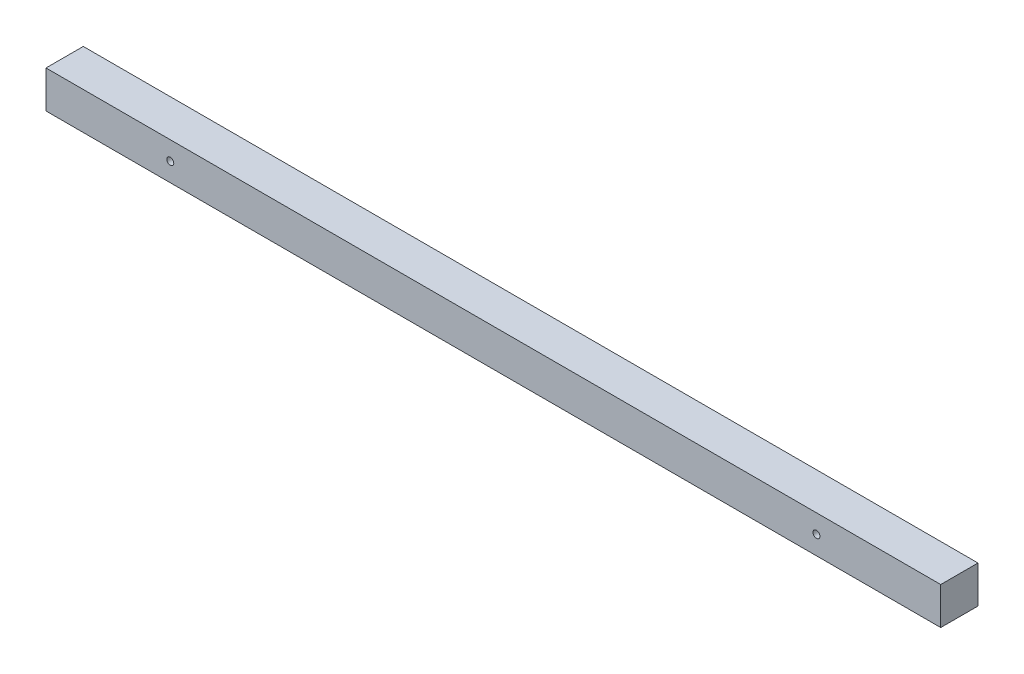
ISO-10303-21;
HEADER;
FILE_DESCRIPTION(('STEP AP214'),'2;1');
FILE_NAME('part.step','',(''),(''),'','','');
FILE_SCHEMA(('AUTOMOTIVE_DESIGN { 1 0 10303 214 1 1 1 1 }'));
ENDSEC;
DATA;
#1=APPLICATION_CONTEXT('core data for automotive mechanical design processes');
#2=APPLICATION_PROTOCOL_DEFINITION('international standard','automotive_design',2000,#1);
#3=PRODUCT_CONTEXT('',#1,'mechanical');
#4=PRODUCT('Part','Part','',(#3));
#5=PRODUCT_RELATED_PRODUCT_CATEGORY('part','',(#4));
#6=PRODUCT_DEFINITION_FORMATION('','',#4);
#7=PRODUCT_DEFINITION_CONTEXT('part definition',#1,'design');
#8=PRODUCT_DEFINITION('design','',#6,#7);
#9=PRODUCT_DEFINITION_SHAPE('','',#8);
#10=(LENGTH_UNIT() NAMED_UNIT(*) SI_UNIT(.MILLI.,.METRE.));
#11=(NAMED_UNIT(*) PLANE_ANGLE_UNIT() SI_UNIT($,.RADIAN.));
#12=(NAMED_UNIT(*) SI_UNIT($,.STERADIAN.) SOLID_ANGLE_UNIT());
#13=UNCERTAINTY_MEASURE_WITH_UNIT(LENGTH_MEASURE(1.E-05),#10,'distance_accuracy_value','');
#14=(GEOMETRIC_REPRESENTATION_CONTEXT(3) GLOBAL_UNCERTAINTY_ASSIGNED_CONTEXT((#13)) GLOBAL_UNIT_ASSIGNED_CONTEXT((#10,
#11,#12)) REPRESENTATION_CONTEXT('',''));
#15=CARTESIAN_POINT('',(0.,0.,0.));
#16=DIRECTION('',(0.,0.,1.));
#17=DIRECTION('',(1.,0.,0.));
#18=AXIS2_PLACEMENT_3D('',#15,#16,#17);
#19=CARTESIAN_POINT('',(457.2,19.05,19.05));
#20=DIRECTION('',(0.,0.,-1.));
#21=DIRECTION('',(-1.,0.,0.));
#22=AXIS2_PLACEMENT_3D('',#19,#20,#21);
#23=PLANE('',#22);
#24=CARTESIAN_POINT('',(330.2,0.,19.0500000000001));
#25=DIRECTION('',(0.,0.,1.));
#26=DIRECTION('',(1.,0.,0.));
#27=AXIS2_PLACEMENT_3D('',#24,#25,#26);
#28=CIRCLE('',#27,3.56869999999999);
#29=CARTESIAN_POINT('',(333.7687,0.,19.0500000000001));
#30=VERTEX_POINT('',#29);
#31=EDGE_CURVE('E118',#30,#30,#28,.T.);
#32=ORIENTED_EDGE('',*,*,#31,.F.);
#33=EDGE_LOOP('',(#32));
#34=FACE_BOUND('',#33,.T.);
#35=CARTESIAN_POINT('',(-330.2,0.,19.05));
#36=DIRECTION('',(0.,0.,1.));
#37=DIRECTION('',(1.,0.,0.));
#38=AXIS2_PLACEMENT_3D('',#35,#36,#37);
#39=CIRCLE('',#38,3.56869999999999);
#40=CARTESIAN_POINT('',(-326.6313,0.,19.05));
#41=VERTEX_POINT('',#40);
#42=EDGE_CURVE('E112',#41,#41,#39,.T.);
#43=ORIENTED_EDGE('',*,*,#42,.F.);
#44=EDGE_LOOP('',(#43));
#45=FACE_BOUND('',#44,.T.);
#46=DIRECTION('',(0.,-1.,0.));
#47=VECTOR('',#46,1.);
#48=CARTESIAN_POINT('',(-457.2,19.05,19.0500000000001));
#49=LINE('',#48,#47);
#50=CARTESIAN_POINT('',(-457.2,19.05,19.0500000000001));
#51=VERTEX_POINT('',#50);
#52=CARTESIAN_POINT('',(-457.2,-19.05,19.05));
#53=VERTEX_POINT('',#52);
#54=EDGE_CURVE('E98',#51,#53,#49,.T.);
#55=ORIENTED_EDGE('',*,*,#54,.T.);
#56=DIRECTION('',(-1.,0.,0.));
#57=VECTOR('',#56,1.);
#58=CARTESIAN_POINT('',(457.2,-19.05,19.05));
#59=LINE('',#58,#57);
#60=CARTESIAN_POINT('',(457.2,-19.05,19.05));
#61=VERTEX_POINT('',#60);
#62=EDGE_CURVE('E11',#61,#53,#59,.T.);
#63=ORIENTED_EDGE('',*,*,#62,.F.);
#64=DIRECTION('',(0.,-1.,0.));
#65=VECTOR('',#64,1.);
#66=CARTESIAN_POINT('',(457.2,19.05,19.05));
#67=LINE('',#66,#65);
#68=CARTESIAN_POINT('',(457.2,19.05,19.05));
#69=VERTEX_POINT('',#68);
#70=EDGE_CURVE('E86',#69,#61,#67,.T.);
#71=ORIENTED_EDGE('',*,*,#70,.F.);
#72=DIRECTION('',(-1.,0.,0.));
#73=VECTOR('',#72,1.);
#74=CARTESIAN_POINT('',(457.2,19.05,19.05));
#75=LINE('',#74,#73);
#76=EDGE_CURVE('E94',#69,#51,#75,.T.);
#77=ORIENTED_EDGE('',*,*,#76,.T.);
#78=EDGE_LOOP('',(#55,#63,#71,#77));
#79=FACE_BOUND('',#78,.T.);
#80=ADVANCED_FACE('F35',(#34,#45,#79),#23,.F.);
#81=CARTESIAN_POINT('',(457.2,-19.05,19.05));
#82=DIRECTION('',(0.,1.,0.));
#83=DIRECTION('',(0.,0.,1.));
#84=AXIS2_PLACEMENT_3D('',#81,#82,#83);
#85=PLANE('',#84);
#86=DIRECTION('',(0.,0.,-1.));
#87=VECTOR('',#86,1.);
#88=CARTESIAN_POINT('',(-457.2,-19.05,19.05));
#89=LINE('',#88,#87);
#90=CARTESIAN_POINT('',(-457.2,-19.05,-19.05));
#91=VERTEX_POINT('',#90);
#92=EDGE_CURVE('E90',#53,#91,#89,.T.);
#93=ORIENTED_EDGE('',*,*,#92,.T.);
#94=DIRECTION('',(-1.,0.,0.));
#95=VECTOR('',#94,1.);
#96=CARTESIAN_POINT('',(457.2,-19.05,-19.05));
#97=LINE('',#96,#95);
#98=CARTESIAN_POINT('',(457.2,-19.05,-19.05));
#99=VERTEX_POINT('',#98);
#100=EDGE_CURVE('E43',#99,#91,#97,.T.);
#101=ORIENTED_EDGE('',*,*,#100,.F.);
#102=DIRECTION('',(0.,0.,-1.));
#103=VECTOR('',#102,1.);
#104=CARTESIAN_POINT('',(457.2,-19.05,19.05));
#105=LINE('',#104,#103);
#106=EDGE_CURVE('E81',#61,#99,#105,.T.);
#107=ORIENTED_EDGE('',*,*,#106,.F.);
#108=ORIENTED_EDGE('',*,*,#62,.T.);
#109=EDGE_LOOP('',(#93,#101,#107,#108));
#110=FACE_BOUND('',#109,.T.);
#111=ADVANCED_FACE('F89',(#110),#85,.F.);
#112=CARTESIAN_POINT('',(457.2,19.05,-19.05));
#113=DIRECTION('',(0.,0.,1.));
#114=DIRECTION('',(0.,-1.,0.));
#115=AXIS2_PLACEMENT_3D('',#112,#113,#114);
#116=PLANE('',#115);
#117=CARTESIAN_POINT('',(330.2,0.,-19.0499999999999));
#118=DIRECTION('',(0.,0.,1.));
#119=DIRECTION('',(1.,0.,0.));
#120=AXIS2_PLACEMENT_3D('',#117,#118,#119);
#121=CIRCLE('',#120,3.56869999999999);
#122=CARTESIAN_POINT('',(333.7687,0.,-19.0499999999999));
#123=VERTEX_POINT('',#122);
#124=EDGE_CURVE('E115',#123,#123,#121,.T.);
#125=ORIENTED_EDGE('',*,*,#124,.T.);
#126=EDGE_LOOP('',(#125));
#127=FACE_BOUND('',#126,.T.);
#128=CARTESIAN_POINT('',(-330.2,0.,-19.05));
#129=DIRECTION('',(0.,0.,1.));
#130=DIRECTION('',(1.,0.,0.));
#131=AXIS2_PLACEMENT_3D('',#128,#129,#130);
#132=CIRCLE('',#131,3.56869999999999);
#133=CARTESIAN_POINT('',(-326.6313,0.,-19.05));
#134=VERTEX_POINT('',#133);
#135=EDGE_CURVE('E101',#134,#134,#132,.T.);
#136=ORIENTED_EDGE('',*,*,#135,.T.);
#137=EDGE_LOOP('',(#136));
#138=FACE_BOUND('',#137,.T.);
#139=DIRECTION('',(0.,1.,0.));
#140=VECTOR('',#139,1.);
#141=CARTESIAN_POINT('',(-457.2,19.05,-19.0499999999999));
#142=LINE('',#141,#140);
#143=CARTESIAN_POINT('',(-457.2,19.05,-19.0499999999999));
#144=VERTEX_POINT('',#143);
#145=EDGE_CURVE('E68',#91,#144,#142,.T.);
#146=ORIENTED_EDGE('',*,*,#145,.T.);
#147=DIRECTION('',(-1.,0.,0.));
#148=VECTOR('',#147,1.);
#149=CARTESIAN_POINT('',(457.2,19.05,-19.05));
#150=LINE('',#149,#148);
#151=CARTESIAN_POINT('',(457.2,19.05,-19.05));
#152=VERTEX_POINT('',#151);
#153=EDGE_CURVE('E91',#152,#144,#150,.T.);
#154=ORIENTED_EDGE('',*,*,#153,.F.);
#155=DIRECTION('',(0.,1.,0.));
#156=VECTOR('',#155,1.);
#157=CARTESIAN_POINT('',(457.2,19.05,-19.05));
#158=LINE('',#157,#156);
#159=EDGE_CURVE('E84',#99,#152,#158,.T.);
#160=ORIENTED_EDGE('',*,*,#159,.F.);
#161=ORIENTED_EDGE('',*,*,#100,.T.);
#162=EDGE_LOOP('',(#146,#154,#160,#161));
#163=FACE_BOUND('',#162,.T.);
#164=ADVANCED_FACE('F92',(#127,#138,#163),#116,.F.);
#165=CARTESIAN_POINT('',(457.2,19.05,19.05));
#166=DIRECTION('',(0.,-1.,0.));
#167=DIRECTION('',(0.,0.,-1.));
#168=AXIS2_PLACEMENT_3D('',#165,#166,#167);
#169=PLANE('',#168);
#170=DIRECTION('',(0.,0.,1.));
#171=VECTOR('',#170,1.);
#172=CARTESIAN_POINT('',(-457.2,19.05,19.0500000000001));
#173=LINE('',#172,#171);
#174=EDGE_CURVE('E74',#144,#51,#173,.T.);
#175=ORIENTED_EDGE('',*,*,#174,.T.);
#176=ORIENTED_EDGE('',*,*,#76,.F.);
#177=DIRECTION('',(0.,0.,1.));
#178=VECTOR('',#177,1.);
#179=CARTESIAN_POINT('',(457.2,19.05,19.05));
#180=LINE('',#179,#178);
#181=EDGE_CURVE('E51',#152,#69,#180,.T.);
#182=ORIENTED_EDGE('',*,*,#181,.F.);
#183=ORIENTED_EDGE('',*,*,#153,.T.);
#184=EDGE_LOOP('',(#175,#176,#182,#183));
#185=FACE_BOUND('',#184,.T.);
#186=ADVANCED_FACE('F106',(#185),#169,.F.);
#187=CARTESIAN_POINT('',(457.2,0.,0.));
#188=DIRECTION('',(1.,0.,0.));
#189=DIRECTION('',(0.,0.,-1.));
#190=AXIS2_PLACEMENT_3D('',#187,#188,#189);
#191=PLANE('',#190);
#192=ORIENTED_EDGE('',*,*,#70,.T.);
#193=ORIENTED_EDGE('',*,*,#106,.T.);
#194=ORIENTED_EDGE('',*,*,#159,.T.);
#195=ORIENTED_EDGE('',*,*,#181,.T.);
#196=EDGE_LOOP('',(#192,#193,#194,#195));
#197=FACE_BOUND('',#196,.T.);
#198=ADVANCED_FACE('F82',(#197),#191,.T.);
#199=CARTESIAN_POINT('',(-457.2,0.,0.));
#200=DIRECTION('',(1.,0.,0.));
#201=DIRECTION('',(0.,0.,-1.));
#202=AXIS2_PLACEMENT_3D('',#199,#200,#201);
#203=PLANE('',#202);
#204=ORIENTED_EDGE('',*,*,#54,.F.);
#205=ORIENTED_EDGE('',*,*,#174,.F.);
#206=ORIENTED_EDGE('',*,*,#145,.F.);
#207=ORIENTED_EDGE('',*,*,#92,.F.);
#208=EDGE_LOOP('',(#204,#205,#206,#207));
#209=FACE_BOUND('',#208,.T.);
#210=ADVANCED_FACE('F109',(#209),#203,.F.);
#211=CARTESIAN_POINT('',(-330.2,0.,-19.05));
#212=DIRECTION('',(0.,0.,1.));
#213=DIRECTION('',(1.,0.,0.));
#214=AXIS2_PLACEMENT_3D('',#211,#212,#213);
#215=CYLINDRICAL_SURFACE('',#214,3.56869999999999);
#216=ORIENTED_EDGE('',*,*,#135,.F.);
#217=EDGE_LOOP('',(#216));
#218=FACE_BOUND('',#217,.T.);
#219=ORIENTED_EDGE('',*,*,#42,.T.);
#220=EDGE_LOOP('',(#219));
#221=FACE_BOUND('',#220,.T.);
#222=ADVANCED_FACE('F129',(#218,#221),#215,.F.);
#223=CARTESIAN_POINT('',(330.2,0.,-19.0499999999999));
#224=DIRECTION('',(0.,0.,1.));
#225=DIRECTION('',(1.,0.,0.));
#226=AXIS2_PLACEMENT_3D('',#223,#224,#225);
#227=CYLINDRICAL_SURFACE('',#226,3.56869999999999);
#228=ORIENTED_EDGE('',*,*,#124,.F.);
#229=EDGE_LOOP('',(#228));
#230=FACE_BOUND('',#229,.T.);
#231=ORIENTED_EDGE('',*,*,#31,.T.);
#232=EDGE_LOOP('',(#231));
#233=FACE_BOUND('',#232,.T.);
#234=ADVANCED_FACE('F126',(#230,#233),#227,.F.);
#235=CLOSED_SHELL('',(#80,#111,#164,#186,#198,#210,#222,#234));
#236=MANIFOLD_SOLID_BREP('B2',#235);
#237=ADVANCED_BREP_SHAPE_REPRESENTATION('',(#18,#236),#14);
#238=SHAPE_DEFINITION_REPRESENTATION(#9,#237);
ENDSEC;
END-ISO-10303-21;
